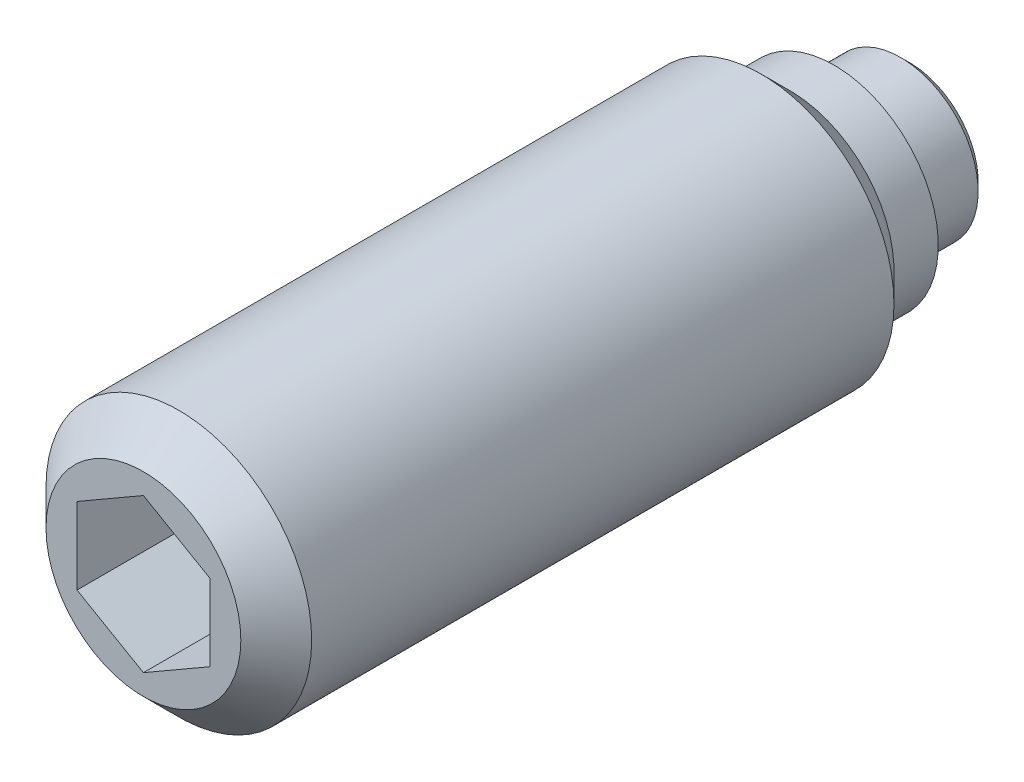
ISO-10303-21;
HEADER;
FILE_DESCRIPTION(('STEP AP214'),'2;1');
FILE_NAME('part.step','',(''),(''),'','','');
FILE_SCHEMA(('AUTOMOTIVE_DESIGN { 1 0 10303 214 1 1 1 1 }'));
ENDSEC;
DATA;
#1=APPLICATION_CONTEXT('core data for automotive mechanical design processes');
#2=APPLICATION_PROTOCOL_DEFINITION('international standard','automotive_design',2000,#1);
#3=PRODUCT_CONTEXT('',#1,'mechanical');
#4=PRODUCT('Part','Part','',(#3));
#5=PRODUCT_RELATED_PRODUCT_CATEGORY('part','',(#4));
#6=PRODUCT_DEFINITION_FORMATION('','',#4);
#7=PRODUCT_DEFINITION_CONTEXT('part definition',#1,'design');
#8=PRODUCT_DEFINITION('design','',#6,#7);
#9=PRODUCT_DEFINITION_SHAPE('','',#8);
#10=(LENGTH_UNIT() NAMED_UNIT(*) SI_UNIT(.MILLI.,.METRE.));
#11=(NAMED_UNIT(*) PLANE_ANGLE_UNIT() SI_UNIT($,.RADIAN.));
#12=(NAMED_UNIT(*) SI_UNIT($,.STERADIAN.) SOLID_ANGLE_UNIT());
#13=UNCERTAINTY_MEASURE_WITH_UNIT(LENGTH_MEASURE(1.E-05),#10,'distance_accuracy_value','');
#14=(GEOMETRIC_REPRESENTATION_CONTEXT(3) GLOBAL_UNCERTAINTY_ASSIGNED_CONTEXT((#13)) GLOBAL_UNIT_ASSIGNED_CONTEXT((#10,
#11,#12)) REPRESENTATION_CONTEXT('',''));
#15=CARTESIAN_POINT('',(0.,0.,0.));
#16=DIRECTION('',(0.,0.,1.));
#17=DIRECTION('',(1.,0.,0.));
#18=AXIS2_PLACEMENT_3D('',#15,#16,#17);
#19=CARTESIAN_POINT('',(0.,0.,0.));
#20=DIRECTION('',(0.,0.,-1.));
#21=DIRECTION('',(-1.,0.,0.));
#22=AXIS2_PLACEMENT_3D('',#19,#20,#21);
#23=CYLINDRICAL_SURFACE('',#22,1.75);
#24=CARTESIAN_POINT('',(0.,0.,0.2));
#25=DIRECTION('',(0.,0.,-1.));
#26=DIRECTION('',(-1.,0.,0.));
#27=AXIS2_PLACEMENT_3D('',#24,#25,#26);
#28=CIRCLE('',#27,1.75);
#29=CARTESIAN_POINT('',(-1.75,0.,0.2));
#30=VERTEX_POINT('',#29);
#31=EDGE_CURVE('E133',#30,#30,#28,.T.);
#32=ORIENTED_EDGE('',*,*,#31,.F.);
#33=EDGE_LOOP('',(#32));
#34=FACE_BOUND('',#33,.T.);
#35=CARTESIAN_POINT('',(0.,0.,1.7));
#36=DIRECTION('',(0.,0.,-1.));
#37=DIRECTION('',(-1.,0.,0.));
#38=AXIS2_PLACEMENT_3D('',#35,#36,#37);
#39=CIRCLE('',#38,1.75);
#40=CARTESIAN_POINT('',(-1.75,0.,1.7));
#41=VERTEX_POINT('',#40);
#42=EDGE_CURVE('E127',#41,#41,#39,.T.);
#43=ORIENTED_EDGE('',*,*,#42,.T.);
#44=EDGE_LOOP('',(#43));
#45=FACE_BOUND('',#44,.T.);
#46=ADVANCED_FACE('F14',(#34,#45),#23,.T.);
#47=CARTESIAN_POINT('',(0.,0.,0.2));
#48=DIRECTION('',(0.,0.,1.));
#49=DIRECTION('',(1.,0.,0.));
#50=AXIS2_PLACEMENT_3D('',#47,#48,#49);
#51=CONICAL_SURFACE('',#50,1.75,0.785398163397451);
#52=CARTESIAN_POINT('',(0.,0.,0.));
#53=DIRECTION('',(0.,0.,-1.));
#54=DIRECTION('',(-1.,0.,0.));
#55=AXIS2_PLACEMENT_3D('',#52,#53,#54);
#56=CIRCLE('',#55,1.55);
#57=CARTESIAN_POINT('',(-1.55,0.,0.));
#58=VERTEX_POINT('',#57);
#59=EDGE_CURVE('E130',#58,#58,#56,.T.);
#60=ORIENTED_EDGE('',*,*,#59,.F.);
#61=EDGE_LOOP('',(#60));
#62=FACE_BOUND('',#61,.T.);
#63=ORIENTED_EDGE('',*,*,#31,.T.);
#64=EDGE_LOOP('',(#63));
#65=FACE_BOUND('',#64,.T.);
#66=ADVANCED_FACE('F159',(#62,#65),#51,.T.);
#67=CARTESIAN_POINT('',(0.,1.55,0.));
#68=DIRECTION('',(0.,0.,1.));
#69=DIRECTION('',(1.,0.,0.));
#70=AXIS2_PLACEMENT_3D('',#67,#68,#69);
#71=PLANE('',#70);
#72=ORIENTED_EDGE('',*,*,#59,.T.);
#73=EDGE_LOOP('',(#72));
#74=FACE_BOUND('',#73,.T.);
#75=ADVANCED_FACE('F165',(#74),#71,.F.);
#76=CARTESIAN_POINT('',(0.,0.,1.7));
#77=DIRECTION('',(0.,0.,-1.));
#78=DIRECTION('',(-1.,0.,0.));
#79=AXIS2_PLACEMENT_3D('',#76,#77,#78);
#80=CYLINDRICAL_SURFACE('',#79,3.);
#81=CARTESIAN_POINT('',(0.,0.,3.35));
#82=DIRECTION('',(0.,0.,-1.));
#83=DIRECTION('',(-1.,0.,0.));
#84=AXIS2_PLACEMENT_3D('',#81,#82,#83);
#85=CIRCLE('',#84,3.);
#86=CARTESIAN_POINT('',(-3.,0.,3.35));
#87=VERTEX_POINT('',#86);
#88=EDGE_CURVE('E9',#87,#87,#85,.T.);
#89=ORIENTED_EDGE('',*,*,#88,.F.);
#90=EDGE_LOOP('',(#89));
#91=FACE_BOUND('',#90,.T.);
#92=CARTESIAN_POINT('',(0.,0.,16.5));
#93=DIRECTION('',(0.,0.,1.));
#94=DIRECTION('',(1.,0.,0.));
#95=AXIS2_PLACEMENT_3D('',#92,#93,#94);
#96=CIRCLE('',#95,3.);
#97=CARTESIAN_POINT('',(3.,0.,16.5));
#98=VERTEX_POINT('',#97);
#99=EDGE_CURVE('E124',#98,#98,#96,.T.);
#100=ORIENTED_EDGE('',*,*,#99,.F.);
#101=EDGE_LOOP('',(#100));
#102=FACE_BOUND('',#101,.T.);
#103=ADVANCED_FACE('F16',(#91,#102),#80,.T.);
#104=CARTESIAN_POINT('',(0.,2.35,1.7));
#105=DIRECTION('',(0.,0.,1.));
#106=DIRECTION('',(1.,0.,0.));
#107=AXIS2_PLACEMENT_3D('',#104,#105,#106);
#108=PLANE('',#107);
#109=CARTESIAN_POINT('',(0.,0.,1.7));
#110=DIRECTION('',(0.,0.,-1.));
#111=DIRECTION('',(-1.,0.,0.));
#112=AXIS2_PLACEMENT_3D('',#109,#110,#111);
#113=CIRCLE('',#112,2.35);
#114=CARTESIAN_POINT('',(-2.35,0.,1.7));
#115=VERTEX_POINT('',#114);
#116=EDGE_CURVE('E136',#115,#115,#113,.T.);
#117=ORIENTED_EDGE('',*,*,#116,.T.);
#118=EDGE_LOOP('',(#117));
#119=FACE_BOUND('',#118,.T.);
#120=ORIENTED_EDGE('',*,*,#42,.F.);
#121=EDGE_LOOP('',(#120));
#122=FACE_BOUND('',#121,.T.);
#123=ADVANCED_FACE('F156',(#119,#122),#108,.F.);
#124=CARTESIAN_POINT('',(0.,0.,1.7));
#125=DIRECTION('',(0.,0.,-1.));
#126=DIRECTION('',(-1.,0.,0.));
#127=AXIS2_PLACEMENT_3D('',#124,#125,#126);
#128=CYLINDRICAL_SURFACE('',#127,2.35);
#129=CARTESIAN_POINT('',(0.,0.,2.7));
#130=DIRECTION('',(0.,0.,-1.));
#131=DIRECTION('',(-1.,0.,0.));
#132=AXIS2_PLACEMENT_3D('',#129,#130,#131);
#133=CIRCLE('',#132,2.35);
#134=CARTESIAN_POINT('',(-2.35,0.,2.7));
#135=VERTEX_POINT('',#134);
#136=EDGE_CURVE('E22',#135,#135,#133,.T.);
#137=ORIENTED_EDGE('',*,*,#136,.T.);
#138=EDGE_LOOP('',(#137));
#139=FACE_BOUND('',#138,.T.);
#140=ORIENTED_EDGE('',*,*,#116,.F.);
#141=EDGE_LOOP('',(#140));
#142=FACE_BOUND('',#141,.T.);
#143=ADVANCED_FACE('F141',(#139,#142),#128,.T.);
#144=CARTESIAN_POINT('',(0.,0.,3.35));
#145=DIRECTION('',(0.,0.,1.));
#146=DIRECTION('',(1.,0.,0.));
#147=AXIS2_PLACEMENT_3D('',#144,#145,#146);
#148=CONICAL_SURFACE('',#147,3.,0.785398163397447);
#149=ORIENTED_EDGE('',*,*,#88,.T.);
#150=EDGE_LOOP('',(#149));
#151=FACE_BOUND('',#150,.T.);
#152=ORIENTED_EDGE('',*,*,#136,.F.);
#153=EDGE_LOOP('',(#152));
#154=FACE_BOUND('',#153,.T.);
#155=ADVANCED_FACE('F144',(#151,#154),#148,.T.);
#156=CARTESIAN_POINT('',(0.,-2.2,17.3));
#157=DIRECTION('',(0.,0.,1.));
#158=DIRECTION('',(1.,0.,0.));
#159=AXIS2_PLACEMENT_3D('',#156,#157,#158);
#160=PLANE('',#159);
#161=DIRECTION('',(0.866025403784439,-0.5,0.));
#162=VECTOR('',#161,1.);
#163=CARTESIAN_POINT('',(-1.5,-0.866025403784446,17.3));
#164=LINE('',#163,#162);
#165=CARTESIAN_POINT('',(-1.5,-0.866025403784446,17.3));
#166=VERTEX_POINT('',#165);
#167=CARTESIAN_POINT('',(0.,-1.73205080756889,17.3));
#168=VERTEX_POINT('',#167);
#169=EDGE_CURVE('E29',#166,#168,#164,.T.);
#170=ORIENTED_EDGE('',*,*,#169,.F.);
#171=DIRECTION('',(0.,-1.,0.));
#172=VECTOR('',#171,1.);
#173=CARTESIAN_POINT('',(-1.5,0.866025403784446,17.3));
#174=LINE('',#173,#172);
#175=CARTESIAN_POINT('',(-1.5,0.866025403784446,17.3));
#176=VERTEX_POINT('',#175);
#177=EDGE_CURVE('E112',#176,#166,#174,.T.);
#178=ORIENTED_EDGE('',*,*,#177,.F.);
#179=DIRECTION('',(-0.866025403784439,-0.5,0.));
#180=VECTOR('',#179,1.);
#181=CARTESIAN_POINT('',(0.,1.73205080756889,17.3));
#182=LINE('',#181,#180);
#183=CARTESIAN_POINT('',(0.,1.73205080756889,17.3));
#184=VERTEX_POINT('',#183);
#185=EDGE_CURVE('E110',#184,#176,#182,.T.);
#186=ORIENTED_EDGE('',*,*,#185,.F.);
#187=DIRECTION('',(-0.866025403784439,0.5,0.));
#188=VECTOR('',#187,1.);
#189=CARTESIAN_POINT('',(1.5,0.866025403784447,17.3));
#190=LINE('',#189,#188);
#191=CARTESIAN_POINT('',(1.5,0.866025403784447,17.3));
#192=VERTEX_POINT('',#191);
#193=EDGE_CURVE('E77',#192,#184,#190,.T.);
#194=ORIENTED_EDGE('',*,*,#193,.F.);
#195=DIRECTION('',(0.,1.,0.));
#196=VECTOR('',#195,1.);
#197=CARTESIAN_POINT('',(1.5,-0.866025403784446,17.3));
#198=LINE('',#197,#196);
#199=CARTESIAN_POINT('',(1.5,-0.866025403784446,17.3));
#200=VERTEX_POINT('',#199);
#201=EDGE_CURVE('E106',#200,#192,#198,.T.);
#202=ORIENTED_EDGE('',*,*,#201,.F.);
#203=DIRECTION('',(0.866025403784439,0.5,0.));
#204=VECTOR('',#203,1.);
#205=CARTESIAN_POINT('',(0.,-1.73205080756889,17.3));
#206=LINE('',#205,#204);
#207=EDGE_CURVE('E103',#168,#200,#206,.T.);
#208=ORIENTED_EDGE('',*,*,#207,.F.);
#209=EDGE_LOOP('',(#170,#178,#186,#194,#202,#208));
#210=FACE_BOUND('',#209,.T.);
#211=CARTESIAN_POINT('',(0.,0.,17.3));
#212=DIRECTION('',(0.,0.,1.));
#213=DIRECTION('',(1.,0.,0.));
#214=AXIS2_PLACEMENT_3D('',#211,#212,#213);
#215=CIRCLE('',#214,2.2);
#216=CARTESIAN_POINT('',(2.2,0.,17.3));
#217=VERTEX_POINT('',#216);
#218=EDGE_CURVE('E116',#217,#217,#215,.T.);
#219=ORIENTED_EDGE('',*,*,#218,.T.);
#220=EDGE_LOOP('',(#219));
#221=FACE_BOUND('',#220,.T.);
#222=ADVANCED_FACE('F146',(#210,#221),#160,.T.);
#223=CARTESIAN_POINT('',(0.,0.,17.3));
#224=DIRECTION('',(0.,0.,-1.));
#225=DIRECTION('',(-1.,0.,0.));
#226=AXIS2_PLACEMENT_3D('',#223,#224,#225);
#227=CONICAL_SURFACE('',#226,2.2,0.785398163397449);
#228=ORIENTED_EDGE('',*,*,#99,.T.);
#229=EDGE_LOOP('',(#228));
#230=FACE_BOUND('',#229,.T.);
#231=ORIENTED_EDGE('',*,*,#218,.F.);
#232=EDGE_LOOP('',(#231));
#233=FACE_BOUND('',#232,.T.);
#234=ADVANCED_FACE('F153',(#230,#233),#227,.T.);
#235=CARTESIAN_POINT('',(-1.5,-0.866025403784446,13.8));
#236=DIRECTION('',(-0.5,-0.866025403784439,0.));
#237=DIRECTION('',(0.866025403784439,-0.5,0.));
#238=AXIS2_PLACEMENT_3D('',#235,#236,#237);
#239=PLANE('',#238);
#240=ORIENTED_EDGE('',*,*,#169,.T.);
#241=DIRECTION('',(0.,0.,1.));
#242=VECTOR('',#241,1.);
#243=CARTESIAN_POINT('',(0.,-1.73205080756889,13.8));
#244=LINE('',#243,#242);
#245=CARTESIAN_POINT('',(0.,-1.73205080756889,13.8));
#246=VERTEX_POINT('',#245);
#247=EDGE_CURVE('E59',#246,#168,#244,.T.);
#248=ORIENTED_EDGE('',*,*,#247,.F.);
#249=DIRECTION('',(0.866025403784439,-0.5,0.));
#250=VECTOR('',#249,1.);
#251=CARTESIAN_POINT('',(-1.5,-0.866025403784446,13.8));
#252=LINE('',#251,#250);
#253=CARTESIAN_POINT('',(-1.5,-0.866025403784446,13.8));
#254=VERTEX_POINT('',#253);
#255=EDGE_CURVE('E114',#254,#246,#252,.T.);
#256=ORIENTED_EDGE('',*,*,#255,.F.);
#257=DIRECTION('',(0.,0.,1.));
#258=VECTOR('',#257,1.);
#259=CARTESIAN_POINT('',(-1.5,-0.866025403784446,13.8));
#260=LINE('',#259,#258);
#261=EDGE_CURVE('E37',#254,#166,#260,.T.);
#262=ORIENTED_EDGE('',*,*,#261,.T.);
#263=EDGE_LOOP('',(#240,#248,#256,#262));
#264=FACE_BOUND('',#263,.T.);
#265=ADVANCED_FACE('F191',(#264),#239,.F.);
#266=CARTESIAN_POINT('',(-1.5,0.866025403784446,13.8));
#267=DIRECTION('',(-1.,0.,0.));
#268=DIRECTION('',(0.,0.,1.));
#269=AXIS2_PLACEMENT_3D('',#266,#267,#268);
#270=PLANE('',#269);
#271=ORIENTED_EDGE('',*,*,#177,.T.);
#272=ORIENTED_EDGE('',*,*,#261,.F.);
#273=DIRECTION('',(0.,-1.,0.));
#274=VECTOR('',#273,1.);
#275=CARTESIAN_POINT('',(-1.5,0.866025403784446,13.8));
#276=LINE('',#275,#274);
#277=CARTESIAN_POINT('',(-1.5,0.866025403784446,13.8));
#278=VERTEX_POINT('',#277);
#279=EDGE_CURVE('E89',#278,#254,#276,.T.);
#280=ORIENTED_EDGE('',*,*,#279,.F.);
#281=DIRECTION('',(0.,0.,1.));
#282=VECTOR('',#281,1.);
#283=CARTESIAN_POINT('',(-1.5,0.866025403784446,13.8));
#284=LINE('',#283,#282);
#285=EDGE_CURVE('E81',#278,#176,#284,.T.);
#286=ORIENTED_EDGE('',*,*,#285,.T.);
#287=EDGE_LOOP('',(#271,#272,#280,#286));
#288=FACE_BOUND('',#287,.T.);
#289=ADVANCED_FACE('F198',(#288),#270,.F.);
#290=CARTESIAN_POINT('',(0.,1.73205080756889,13.8));
#291=DIRECTION('',(-0.5,0.866025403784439,0.));
#292=DIRECTION('',(-0.866025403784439,-0.5,0.));
#293=AXIS2_PLACEMENT_3D('',#290,#291,#292);
#294=PLANE('',#293);
#295=ORIENTED_EDGE('',*,*,#185,.T.);
#296=ORIENTED_EDGE('',*,*,#285,.F.);
#297=DIRECTION('',(-0.866025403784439,-0.5,0.));
#298=VECTOR('',#297,1.);
#299=CARTESIAN_POINT('',(0.,1.73205080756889,13.8));
#300=LINE('',#299,#298);
#301=CARTESIAN_POINT('',(0.,1.73205080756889,13.8));
#302=VERTEX_POINT('',#301);
#303=EDGE_CURVE('E85',#302,#278,#300,.T.);
#304=ORIENTED_EDGE('',*,*,#303,.F.);
#305=DIRECTION('',(0.,0.,1.));
#306=VECTOR('',#305,1.);
#307=CARTESIAN_POINT('',(0.,1.73205080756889,13.8));
#308=LINE('',#307,#306);
#309=EDGE_CURVE('E70',#302,#184,#308,.T.);
#310=ORIENTED_EDGE('',*,*,#309,.T.);
#311=EDGE_LOOP('',(#295,#296,#304,#310));
#312=FACE_BOUND('',#311,.T.);
#313=ADVANCED_FACE('F86',(#312),#294,.F.);
#314=CARTESIAN_POINT('',(1.5,0.866025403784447,13.8));
#315=DIRECTION('',(0.5,0.866025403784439,0.));
#316=DIRECTION('',(-0.866025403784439,0.5,0.));
#317=AXIS2_PLACEMENT_3D('',#314,#315,#316);
#318=PLANE('',#317);
#319=ORIENTED_EDGE('',*,*,#193,.T.);
#320=ORIENTED_EDGE('',*,*,#309,.F.);
#321=DIRECTION('',(-0.866025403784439,0.5,0.));
#322=VECTOR('',#321,1.);
#323=CARTESIAN_POINT('',(1.5,0.866025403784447,13.8));
#324=LINE('',#323,#322);
#325=CARTESIAN_POINT('',(1.5,0.866025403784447,13.8));
#326=VERTEX_POINT('',#325);
#327=EDGE_CURVE('E74',#326,#302,#324,.T.);
#328=ORIENTED_EDGE('',*,*,#327,.F.);
#329=DIRECTION('',(0.,0.,1.));
#330=VECTOR('',#329,1.);
#331=CARTESIAN_POINT('',(1.5,0.866025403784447,13.8));
#332=LINE('',#331,#330);
#333=EDGE_CURVE('E82',#326,#192,#332,.T.);
#334=ORIENTED_EDGE('',*,*,#333,.T.);
#335=EDGE_LOOP('',(#319,#320,#328,#334));
#336=FACE_BOUND('',#335,.T.);
#337=ADVANCED_FACE('F72',(#336),#318,.F.);
#338=CARTESIAN_POINT('',(1.5,-0.866025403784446,13.8));
#339=DIRECTION('',(1.,0.,0.));
#340=DIRECTION('',(0.,1.,0.));
#341=AXIS2_PLACEMENT_3D('',#338,#339,#340);
#342=PLANE('',#341);
#343=ORIENTED_EDGE('',*,*,#201,.T.);
#344=ORIENTED_EDGE('',*,*,#333,.F.);
#345=DIRECTION('',(0.,1.,0.));
#346=VECTOR('',#345,1.);
#347=CARTESIAN_POINT('',(1.5,-0.866025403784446,13.8));
#348=LINE('',#347,#346);
#349=CARTESIAN_POINT('',(1.5,-0.866025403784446,13.8));
#350=VERTEX_POINT('',#349);
#351=EDGE_CURVE('E95',#350,#326,#348,.T.);
#352=ORIENTED_EDGE('',*,*,#351,.F.);
#353=DIRECTION('',(0.,0.,1.));
#354=VECTOR('',#353,1.);
#355=CARTESIAN_POINT('',(1.5,-0.866025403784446,13.8));
#356=LINE('',#355,#354);
#357=EDGE_CURVE('E119',#350,#200,#356,.T.);
#358=ORIENTED_EDGE('',*,*,#357,.T.);
#359=EDGE_LOOP('',(#343,#344,#352,#358));
#360=FACE_BOUND('',#359,.T.);
#361=ADVANCED_FACE('F204',(#360),#342,.F.);
#362=CARTESIAN_POINT('',(0.,-1.73205080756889,13.8));
#363=DIRECTION('',(0.5,-0.866025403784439,0.));
#364=DIRECTION('',(0.866025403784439,0.5,0.));
#365=AXIS2_PLACEMENT_3D('',#362,#363,#364);
#366=PLANE('',#365);
#367=ORIENTED_EDGE('',*,*,#207,.T.);
#368=ORIENTED_EDGE('',*,*,#357,.F.);
#369=DIRECTION('',(0.866025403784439,0.5,0.));
#370=VECTOR('',#369,1.);
#371=CARTESIAN_POINT('',(0.,-1.73205080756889,13.8));
#372=LINE('',#371,#370);
#373=EDGE_CURVE('E97',#246,#350,#372,.T.);
#374=ORIENTED_EDGE('',*,*,#373,.F.);
#375=ORIENTED_EDGE('',*,*,#247,.T.);
#376=EDGE_LOOP('',(#367,#368,#374,#375));
#377=FACE_BOUND('',#376,.T.);
#378=ADVANCED_FACE('F201',(#377),#366,.F.);
#379=CARTESIAN_POINT('',(0.,0.,13.8));
#380=DIRECTION('',(0.,0.,1.));
#381=DIRECTION('',(1.,0.,0.));
#382=AXIS2_PLACEMENT_3D('',#379,#380,#381);
#383=PLANE('',#382);
#384=ORIENTED_EDGE('',*,*,#255,.T.);
#385=ORIENTED_EDGE('',*,*,#373,.T.);
#386=ORIENTED_EDGE('',*,*,#351,.T.);
#387=ORIENTED_EDGE('',*,*,#327,.T.);
#388=ORIENTED_EDGE('',*,*,#303,.T.);
#389=ORIENTED_EDGE('',*,*,#279,.T.);
#390=EDGE_LOOP('',(#384,#385,#386,#387,#388,#389));
#391=FACE_BOUND('',#390,.T.);
#392=ADVANCED_FACE('F92',(#391),#383,.T.);
#393=CLOSED_SHELL('',(#46,#66,#75,#103,#123,#143,#155,#222,#234,#265,#289,#313,#337,#361,#378,#392));
#394=MANIFOLD_SOLID_BREP('B1',#393);
#395=ADVANCED_BREP_SHAPE_REPRESENTATION('',(#18,#394),#14);
#396=SHAPE_DEFINITION_REPRESENTATION(#9,#395);
ENDSEC;
END-ISO-10303-21;
